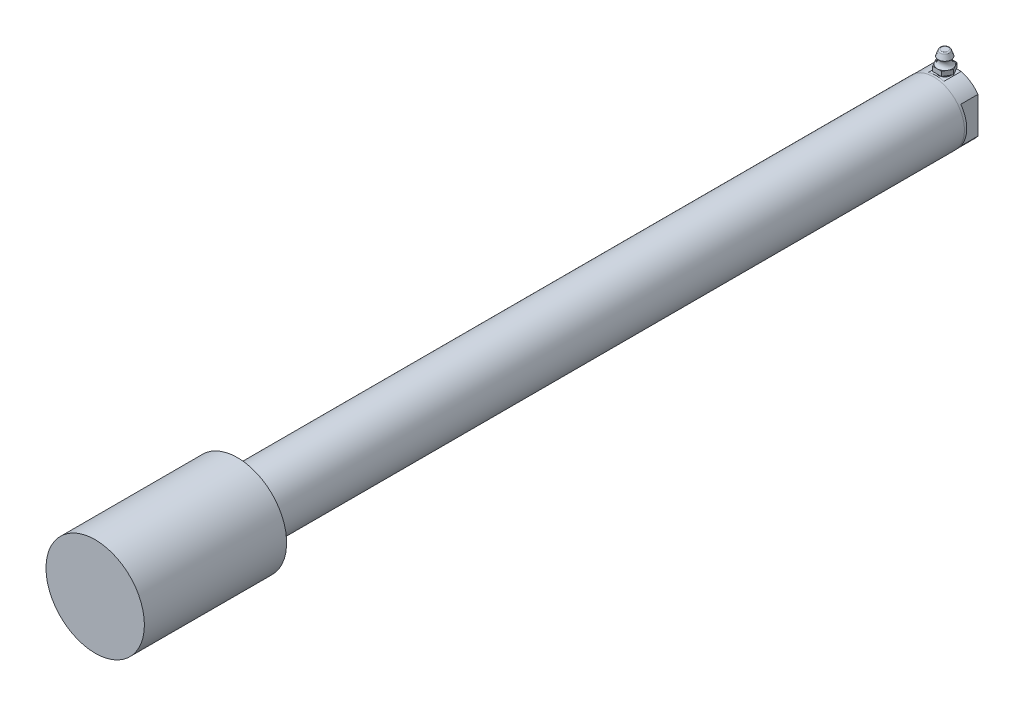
ISO-10303-21;
HEADER;
FILE_DESCRIPTION(('STEP AP214'),'2;1');
FILE_NAME('part.step','',(''),(''),'','','');
FILE_SCHEMA(('AUTOMOTIVE_DESIGN { 1 0 10303 214 1 1 1 1 }'));
ENDSEC;
DATA;
#1=APPLICATION_CONTEXT('core data for automotive mechanical design processes');
#2=APPLICATION_PROTOCOL_DEFINITION('international standard','automotive_design',2000,#1);
#3=PRODUCT_CONTEXT('',#1,'mechanical');
#4=PRODUCT('Part','Part','',(#3));
#5=PRODUCT_RELATED_PRODUCT_CATEGORY('part','',(#4));
#6=PRODUCT_DEFINITION_FORMATION('','',#4);
#7=PRODUCT_DEFINITION_CONTEXT('part definition',#1,'design');
#8=PRODUCT_DEFINITION('design','',#6,#7);
#9=PRODUCT_DEFINITION_SHAPE('','',#8);
#10=(LENGTH_UNIT() NAMED_UNIT(*) SI_UNIT(.MILLI.,.METRE.));
#11=(NAMED_UNIT(*) PLANE_ANGLE_UNIT() SI_UNIT($,.RADIAN.));
#12=(NAMED_UNIT(*) SI_UNIT($,.STERADIAN.) SOLID_ANGLE_UNIT());
#13=UNCERTAINTY_MEASURE_WITH_UNIT(LENGTH_MEASURE(1.E-05),#10,'distance_accuracy_value','');
#14=(GEOMETRIC_REPRESENTATION_CONTEXT(3) GLOBAL_UNCERTAINTY_ASSIGNED_CONTEXT((#13)) GLOBAL_UNIT_ASSIGNED_CONTEXT((#10,
#11,#12)) REPRESENTATION_CONTEXT('',''));
#15=CARTESIAN_POINT('',(0.,0.,0.));
#16=DIRECTION('',(0.,0.,1.));
#17=DIRECTION('',(1.,0.,0.));
#18=AXIS2_PLACEMENT_3D('',#15,#16,#17);
#19=CARTESIAN_POINT('',(0.,0.,10.16));
#20=DIRECTION('',(0.,0.,-1.));
#21=DIRECTION('',(0.,1.,0.));
#22=AXIS2_PLACEMENT_3D('',#19,#20,#21);
#23=CYLINDRICAL_SURFACE('',#22,15.7607);
#24=DIRECTION('',(0.,0.,-1.));
#25=VECTOR('',#24,1.);
#26=CARTESIAN_POINT('',(4.01771881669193,15.24,8.89));
#27=LINE('',#26,#25);
#28=CARTESIAN_POINT('',(4.01771881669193,15.24,8.89));
#29=VERTEX_POINT('',#28);
#30=CARTESIAN_POINT('',(4.01771881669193,15.24,0.));
#31=VERTEX_POINT('',#30);
#32=EDGE_CURVE('E86',#29,#31,#27,.T.);
#33=ORIENTED_EDGE('',*,*,#32,.F.);
#34=CARTESIAN_POINT('',(0.,0.,8.89));
#35=DIRECTION('',(0.,0.,-1.));
#36=DIRECTION('',(0.,1.,0.));
#37=AXIS2_PLACEMENT_3D('',#34,#35,#36);
#38=CIRCLE('',#37,15.7607);
#39=CARTESIAN_POINT('',(-4.01771881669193,15.24,8.89));
#40=VERTEX_POINT('',#39);
#41=EDGE_CURVE('E270',#29,#40,#38,.F.);
#42=ORIENTED_EDGE('',*,*,#41,.T.);
#43=DIRECTION('',(0.,0.,-1.));
#44=VECTOR('',#43,1.);
#45=CARTESIAN_POINT('',(-4.01771881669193,15.24,8.89));
#46=LINE('',#45,#44);
#47=CARTESIAN_POINT('',(-4.01771881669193,15.24,0.));
#48=VERTEX_POINT('',#47);
#49=EDGE_CURVE('E230',#40,#48,#46,.T.);
#50=ORIENTED_EDGE('',*,*,#49,.T.);
#51=CARTESIAN_POINT('',(0.,0.,0.));
#52=DIRECTION('',(0.,0.,-1.));
#53=DIRECTION('',(0.,1.,0.));
#54=AXIS2_PLACEMENT_3D('',#51,#52,#53);
#55=CIRCLE('',#54,15.7607);
#56=CARTESIAN_POINT('',(-12.7,9.33325583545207,0.));
#57=VERTEX_POINT('',#56);
#58=EDGE_CURVE('E274',#57,#48,#55,.T.);
#59=ORIENTED_EDGE('',*,*,#58,.F.);
#60=DIRECTION('',(0.,0.,-1.));
#61=VECTOR('',#60,1.);
#62=CARTESIAN_POINT('',(-12.7,9.33325583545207,8.89));
#63=LINE('',#62,#61);
#64=CARTESIAN_POINT('',(-12.7,9.33325583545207,8.89));
#65=VERTEX_POINT('',#64);
#66=EDGE_CURVE('E79',#65,#57,#63,.T.);
#67=ORIENTED_EDGE('',*,*,#66,.F.);
#68=CARTESIAN_POINT('',(0.,0.,8.89));
#69=DIRECTION('',(0.,0.,-1.));
#70=DIRECTION('',(0.,1.,0.));
#71=AXIS2_PLACEMENT_3D('',#68,#69,#70);
#72=CIRCLE('',#71,15.7607);
#73=CARTESIAN_POINT('',(-12.7,-9.33325583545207,8.89));
#74=VERTEX_POINT('',#73);
#75=EDGE_CURVE('E237',#74,#65,#72,.T.);
#76=ORIENTED_EDGE('',*,*,#75,.F.);
#77=DIRECTION('',(0.,0.,-1.));
#78=VECTOR('',#77,1.);
#79=CARTESIAN_POINT('',(-12.7,-9.33325583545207,8.89));
#80=LINE('',#79,#78);
#81=CARTESIAN_POINT('',(-12.7,-9.33325583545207,0.));
#82=VERTEX_POINT('',#81);
#83=EDGE_CURVE('E243',#74,#82,#80,.T.);
#84=ORIENTED_EDGE('',*,*,#83,.T.);
#85=CARTESIAN_POINT('',(12.7,-9.33325583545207,0.));
#86=VERTEX_POINT('',#85);
#87=EDGE_CURVE('E271',#86,#82,#55,.T.);
#88=ORIENTED_EDGE('',*,*,#87,.F.);
#89=DIRECTION('',(0.,0.,-1.));
#90=VECTOR('',#89,1.);
#91=CARTESIAN_POINT('',(12.7,-9.33325583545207,8.89));
#92=LINE('',#91,#90);
#93=CARTESIAN_POINT('',(12.7,-9.33325583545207,8.89));
#94=VERTEX_POINT('',#93);
#95=EDGE_CURVE('E253',#94,#86,#92,.T.);
#96=ORIENTED_EDGE('',*,*,#95,.F.);
#97=CARTESIAN_POINT('',(0.,0.,8.89));
#98=DIRECTION('',(0.,0.,-1.));
#99=DIRECTION('',(0.,1.,0.));
#100=AXIS2_PLACEMENT_3D('',#97,#98,#99);
#101=CIRCLE('',#100,15.7607);
#102=CARTESIAN_POINT('',(12.7,9.33325583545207,8.89));
#103=VERTEX_POINT('',#102);
#104=EDGE_CURVE('E248',#103,#94,#101,.T.);
#105=ORIENTED_EDGE('',*,*,#104,.F.);
#106=DIRECTION('',(0.,0.,-1.));
#107=VECTOR('',#106,1.);
#108=CARTESIAN_POINT('',(12.7,9.33325583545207,8.89));
#109=LINE('',#108,#107);
#110=CARTESIAN_POINT('',(12.7,9.33325583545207,0.));
#111=VERTEX_POINT('',#110);
#112=EDGE_CURVE('E256',#103,#111,#109,.T.);
#113=ORIENTED_EDGE('',*,*,#112,.T.);
#114=EDGE_CURVE('E266',#31,#111,#55,.T.);
#115=ORIENTED_EDGE('',*,*,#114,.F.);
#116=EDGE_LOOP('',(#33,#42,#50,#59,#67,#76,#84,#88,#96,#105,#113,#115));
#117=FACE_BOUND('',#116,.T.);
#118=CARTESIAN_POINT('',(0.,0.,10.16));
#119=DIRECTION('',(0.,0.,-1.));
#120=DIRECTION('',(0.,1.,0.));
#121=AXIS2_PLACEMENT_3D('',#118,#119,#120);
#122=CIRCLE('',#121,15.7607);
#123=CARTESIAN_POINT('',(0.,15.7607,10.16));
#124=VERTEX_POINT('',#123);
#125=EDGE_CURVE('E267',#124,#124,#122,.T.);
#126=ORIENTED_EDGE('',*,*,#125,.T.);
#127=EDGE_LOOP('',(#126));
#128=FACE_BOUND('',#127,.T.);
#129=ADVANCED_FACE('F16',(#117,#128),#23,.T.);
#130=CARTESIAN_POINT('',(0.,0.,0.));
#131=DIRECTION('',(0.,0.,-1.));
#132=DIRECTION('',(0.,1.,0.));
#133=AXIS2_PLACEMENT_3D('',#130,#131,#132);
#134=PLANE('',#133);
#135=DIRECTION('',(-1.,0.,0.));
#136=VECTOR('',#135,1.);
#137=CARTESIAN_POINT('',(4.01771881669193,15.24,0.));
#138=LINE('',#137,#136);
#139=EDGE_CURVE('E231',#31,#48,#138,.T.);
#140=ORIENTED_EDGE('',*,*,#139,.F.);
#141=ORIENTED_EDGE('',*,*,#114,.T.);
#142=DIRECTION('',(0.,1.,0.));
#143=VECTOR('',#142,1.);
#144=CARTESIAN_POINT('',(12.7,-9.33325583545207,0.));
#145=LINE('',#144,#143);
#146=EDGE_CURVE('E246',#86,#111,#145,.T.);
#147=ORIENTED_EDGE('',*,*,#146,.F.);
#148=ORIENTED_EDGE('',*,*,#87,.T.);
#149=DIRECTION('',(0.,-1.,0.));
#150=VECTOR('',#149,1.);
#151=CARTESIAN_POINT('',(-12.7,-9.33325583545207,0.));
#152=LINE('',#151,#150);
#153=EDGE_CURVE('E234',#57,#82,#152,.T.);
#154=ORIENTED_EDGE('',*,*,#153,.F.);
#155=ORIENTED_EDGE('',*,*,#58,.T.);
#156=EDGE_LOOP('',(#140,#141,#147,#148,#154,#155));
#157=FACE_BOUND('',#156,.T.);
#158=CARTESIAN_POINT('',(0.,0.,0.));
#159=DIRECTION('',(0.,0.,-1.));
#160=DIRECTION('',(0.,1.,0.));
#161=AXIS2_PLACEMENT_3D('',#158,#159,#160);
#162=CIRCLE('',#161,4.96062);
#163=CARTESIAN_POINT('',(0.,4.96062,0.));
#164=VERTEX_POINT('',#163);
#165=EDGE_CURVE('E263',#164,#164,#162,.T.);
#166=ORIENTED_EDGE('',*,*,#165,.F.);
#167=EDGE_LOOP('',(#166));
#168=FACE_BOUND('',#167,.T.);
#169=ADVANCED_FACE('F383',(#157,#168),#134,.T.);
#170=CARTESIAN_POINT('',(0.,0.,0.));
#171=DIRECTION('',(0.,0.,-1.));
#172=DIRECTION('',(0.,1.,0.));
#173=AXIS2_PLACEMENT_3D('',#170,#171,#172);
#174=CYLINDRICAL_SURFACE('',#173,4.96062);
#175=CARTESIAN_POINT('',(0.,0.,32.512));
#176=DIRECTION('',(0.,0.,-1.));
#177=DIRECTION('',(0.,1.,0.));
#178=AXIS2_PLACEMENT_3D('',#175,#176,#177);
#179=CIRCLE('',#178,4.96062);
#180=CARTESIAN_POINT('',(0.,4.96062,32.512));
#181=VERTEX_POINT('',#180);
#182=EDGE_CURVE('E259',#181,#181,#179,.T.);
#183=ORIENTED_EDGE('',*,*,#182,.F.);
#184=EDGE_LOOP('',(#183));
#185=FACE_BOUND('',#184,.T.);
#186=ORIENTED_EDGE('',*,*,#165,.T.);
#187=EDGE_LOOP('',(#186));
#188=FACE_BOUND('',#187,.T.);
#189=ADVANCED_FACE('F379',(#185,#188),#174,.F.);
#190=CARTESIAN_POINT('',(0.,0.,32.512));
#191=DIRECTION('',(0.,0.,-1.));
#192=DIRECTION('',(0.,1.,0.));
#193=AXIS2_PLACEMENT_3D('',#190,#191,#192);
#194=CONICAL_SURFACE('',#193,4.96062,1.02974425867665);
#195=CARTESIAN_POINT('',(0.,0.,35.4926412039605));
#196=VERTEX_POINT('',#195);
#197=VERTEX_LOOP('',#196);
#198=FACE_BOUND('',#197,.T.);
#199=ORIENTED_EDGE('',*,*,#182,.T.);
#200=EDGE_LOOP('',(#199));
#201=FACE_BOUND('',#200,.T.);
#202=ADVANCED_FACE('F375',(#198,#201),#194,.F.);
#203=CARTESIAN_POINT('',(12.7,-9.33325583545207,8.89));
#204=DIRECTION('',(-1.,0.,0.));
#205=DIRECTION('',(0.,0.,1.));
#206=AXIS2_PLACEMENT_3D('',#203,#204,#205);
#207=PLANE('',#206);
#208=ORIENTED_EDGE('',*,*,#146,.T.);
#209=ORIENTED_EDGE('',*,*,#112,.F.);
#210=DIRECTION('',(0.,1.,0.));
#211=VECTOR('',#210,1.);
#212=CARTESIAN_POINT('',(12.7,-9.33325583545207,8.89));
#213=LINE('',#212,#211);
#214=EDGE_CURVE('E250',#94,#103,#213,.T.);
#215=ORIENTED_EDGE('',*,*,#214,.F.);
#216=ORIENTED_EDGE('',*,*,#95,.T.);
#217=EDGE_LOOP('',(#208,#209,#215,#216));
#218=FACE_BOUND('',#217,.T.);
#219=ADVANCED_FACE('F371',(#218),#207,.F.);
#220=CARTESIAN_POINT('',(0.,0.,8.89));
#221=DIRECTION('',(0.,0.,-1.));
#222=DIRECTION('',(0.,1.,0.));
#223=AXIS2_PLACEMENT_3D('',#220,#221,#222);
#224=PLANE('',#223);
#225=ORIENTED_EDGE('',*,*,#104,.T.);
#226=ORIENTED_EDGE('',*,*,#214,.T.);
#227=EDGE_LOOP('',(#225,#226));
#228=FACE_BOUND('',#227,.T.);
#229=ADVANCED_FACE('F368',(#228),#224,.T.);
#230=CARTESIAN_POINT('',(-12.7,-9.33325583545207,8.89));
#231=DIRECTION('',(1.,0.,0.));
#232=DIRECTION('',(0.,0.,-1.));
#233=AXIS2_PLACEMENT_3D('',#230,#231,#232);
#234=PLANE('',#233);
#235=ORIENTED_EDGE('',*,*,#153,.T.);
#236=ORIENTED_EDGE('',*,*,#83,.F.);
#237=DIRECTION('',(0.,-1.,0.));
#238=VECTOR('',#237,1.);
#239=CARTESIAN_POINT('',(-12.7,-9.33325583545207,8.89));
#240=LINE('',#239,#238);
#241=EDGE_CURVE('E239',#65,#74,#240,.T.);
#242=ORIENTED_EDGE('',*,*,#241,.F.);
#243=ORIENTED_EDGE('',*,*,#66,.T.);
#244=EDGE_LOOP('',(#235,#236,#242,#243));
#245=FACE_BOUND('',#244,.T.);
#246=ADVANCED_FACE('F364',(#245),#234,.F.);
#247=CARTESIAN_POINT('',(0.,0.,8.89));
#248=DIRECTION('',(0.,0.,-1.));
#249=DIRECTION('',(0.,1.,0.));
#250=AXIS2_PLACEMENT_3D('',#247,#248,#249);
#251=PLANE('',#250);
#252=ORIENTED_EDGE('',*,*,#75,.T.);
#253=ORIENTED_EDGE('',*,*,#241,.T.);
#254=EDGE_LOOP('',(#252,#253));
#255=FACE_BOUND('',#254,.T.);
#256=ADVANCED_FACE('F360',(#255),#251,.T.);
#257=CARTESIAN_POINT('',(4.01771881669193,15.24,8.89));
#258=DIRECTION('',(0.,-1.,0.));
#259=DIRECTION('',(0.,0.,-1.));
#260=AXIS2_PLACEMENT_3D('',#257,#258,#259);
#261=PLANE('',#260);
#262=CARTESIAN_POINT('',(0.,15.24,4.445));
#263=DIRECTION('',(0.,-1.,0.));
#264=DIRECTION('',(1.,0.,0.));
#265=AXIS2_PLACEMENT_3D('',#262,#263,#264);
#266=CIRCLE('',#265,3.21504291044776);
#267=CARTESIAN_POINT('',(3.21504291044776,15.24,4.445));
#268=VERTEX_POINT('',#267);
#269=EDGE_CURVE('E10',#268,#268,#266,.F.);
#270=ORIENTED_EDGE('',*,*,#269,.F.);
#271=EDGE_LOOP('',(#270));
#272=FACE_BOUND('',#271,.T.);
#273=ORIENTED_EDGE('',*,*,#139,.T.);
#274=ORIENTED_EDGE('',*,*,#49,.F.);
#275=DIRECTION('',(-1.,0.,0.));
#276=VECTOR('',#275,1.);
#277=CARTESIAN_POINT('',(4.01771881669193,15.24,8.89));
#278=LINE('',#277,#276);
#279=EDGE_CURVE('E227',#29,#40,#278,.T.);
#280=ORIENTED_EDGE('',*,*,#279,.F.);
#281=ORIENTED_EDGE('',*,*,#32,.T.);
#282=EDGE_LOOP('',(#273,#274,#280,#281));
#283=FACE_BOUND('',#282,.T.);
#284=ADVANCED_FACE('F356',(#272,#283),#261,.F.);
#285=CARTESIAN_POINT('',(-4.01771881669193,15.24,8.89));
#286=DIRECTION('',(0.,0.,-1.));
#287=DIRECTION('',(0.,1.,0.));
#288=AXIS2_PLACEMENT_3D('',#285,#286,#287);
#289=PLANE('',#288);
#290=ORIENTED_EDGE('',*,*,#41,.F.);
#291=ORIENTED_EDGE('',*,*,#279,.T.);
#292=EDGE_LOOP('',(#290,#291));
#293=FACE_BOUND('',#292,.T.);
#294=ADVANCED_FACE('F353',(#293),#289,.T.);
#295=CARTESIAN_POINT('',(0.,0.,443.08014));
#296=DIRECTION('',(0.,0.,1.));
#297=DIRECTION('',(1.,0.,0.));
#298=AXIS2_PLACEMENT_3D('',#295,#296,#297);
#299=PLANE('',#298);
#300=CARTESIAN_POINT('',(0.,0.,443.08014));
#301=DIRECTION('',(0.,0.,1.));
#302=DIRECTION('',(1.,0.,0.));
#303=AXIS2_PLACEMENT_3D('',#300,#301,#302);
#304=CIRCLE('',#303,25.4);
#305=CARTESIAN_POINT('',(25.4,0.,443.08014));
#306=VERTEX_POINT('',#305);
#307=EDGE_CURVE('E279',#306,#306,#304,.T.);
#308=ORIENTED_EDGE('',*,*,#307,.T.);
#309=EDGE_LOOP('',(#308));
#310=FACE_BOUND('',#309,.T.);
#311=ADVANCED_FACE('F303',(#310),#299,.T.);
#312=CARTESIAN_POINT('',(0.,0.,443.08014));
#313=DIRECTION('',(0.,0.,-1.));
#314=DIRECTION('',(-1.,0.,0.));
#315=AXIS2_PLACEMENT_3D('',#312,#313,#314);
#316=CYLINDRICAL_SURFACE('',#315,25.4);
#317=ORIENTED_EDGE('',*,*,#307,.F.);
#318=EDGE_LOOP('',(#317));
#319=FACE_BOUND('',#318,.T.);
#320=CARTESIAN_POINT('',(0.,0.,369.6462));
#321=DIRECTION('',(0.,0.,-1.));
#322=DIRECTION('',(-1.,0.,0.));
#323=AXIS2_PLACEMENT_3D('',#320,#321,#322);
#324=CIRCLE('',#323,25.4);
#325=CARTESIAN_POINT('',(-25.4,0.,369.6462));
#326=VERTEX_POINT('',#325);
#327=EDGE_CURVE('E276',#326,#326,#324,.T.);
#328=ORIENTED_EDGE('',*,*,#327,.F.);
#329=EDGE_LOOP('',(#328));
#330=FACE_BOUND('',#329,.T.);
#331=ADVANCED_FACE('F301',(#319,#330),#316,.T.);
#332=CARTESIAN_POINT('',(0.,0.,369.6462));
#333=DIRECTION('',(0.,0.,-1.));
#334=DIRECTION('',(-1.,0.,0.));
#335=AXIS2_PLACEMENT_3D('',#332,#333,#334);
#336=PLANE('',#335);
#337=CARTESIAN_POINT('',(0.,0.,369.6462));
#338=DIRECTION('',(0.,0.,-1.));
#339=DIRECTION('',(-1.,0.,0.));
#340=AXIS2_PLACEMENT_3D('',#337,#338,#339);
#341=CIRCLE('',#340,15.8496);
#342=CARTESIAN_POINT('',(-15.8496,0.,369.6462));
#343=VERTEX_POINT('',#342);
#344=EDGE_CURVE('E20',#343,#343,#341,.F.);
#345=ORIENTED_EDGE('',*,*,#344,.T.);
#346=EDGE_LOOP('',(#345));
#347=FACE_BOUND('',#346,.T.);
#348=ORIENTED_EDGE('',*,*,#327,.T.);
#349=EDGE_LOOP('',(#348));
#350=FACE_BOUND('',#349,.T.);
#351=ADVANCED_FACE('F288',(#347,#350),#336,.T.);
#352=CARTESIAN_POINT('',(0.,0.,382.0922));
#353=DIRECTION('',(0.,0.,-1.));
#354=DIRECTION('',(-1.,0.,0.));
#355=AXIS2_PLACEMENT_3D('',#352,#353,#354);
#356=CYLINDRICAL_SURFACE('',#355,15.8496);
#357=ORIENTED_EDGE('',*,*,#344,.F.);
#358=EDGE_LOOP('',(#357));
#359=FACE_BOUND('',#358,.T.);
#360=CARTESIAN_POINT('',(0.,0.,10.16));
#361=DIRECTION('',(0.,0.,-1.));
#362=DIRECTION('',(-1.,0.,0.));
#363=AXIS2_PLACEMENT_3D('',#360,#361,#362);
#364=CIRCLE('',#363,15.8496);
#365=CARTESIAN_POINT('',(-15.8496,0.,10.16));
#366=VERTEX_POINT('',#365);
#367=EDGE_CURVE('E281',#366,#366,#364,.T.);
#368=ORIENTED_EDGE('',*,*,#367,.F.);
#369=EDGE_LOOP('',(#368));
#370=FACE_BOUND('',#369,.T.);
#371=ADVANCED_FACE('F18',(#359,#370),#356,.T.);
#372=CARTESIAN_POINT('',(0.,0.,10.16));
#373=DIRECTION('',(0.,0.,-1.));
#374=DIRECTION('',(-1.,0.,0.));
#375=AXIS2_PLACEMENT_3D('',#372,#373,#374);
#376=PLANE('',#375);
#377=ORIENTED_EDGE('',*,*,#367,.T.);
#378=EDGE_LOOP('',(#377));
#379=FACE_BOUND('',#378,.T.);
#380=ORIENTED_EDGE('',*,*,#125,.F.);
#381=EDGE_LOOP('',(#380));
#382=FACE_BOUND('',#381,.T.);
#383=ADVANCED_FACE('F293',(#379,#382),#376,.T.);
#384=CARTESIAN_POINT('',(0.,25.4,4.445));
#385=DIRECTION('',(0.,1.,0.));
#386=DIRECTION('',(0.,0.,1.));
#387=AXIS2_PLACEMENT_3D('',#384,#385,#386);
#388=PLANE('',#387);
#389=CARTESIAN_POINT('',(0.,25.4,4.445));
#390=DIRECTION('',(0.,1.,0.));
#391=DIRECTION('',(0.,0.,1.));
#392=AXIS2_PLACEMENT_3D('',#389,#390,#391);
#393=CIRCLE('',#392,1.7474960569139);
#394=CARTESIAN_POINT('',(0.,25.4,6.1924960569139));
#395=VERTEX_POINT('',#394);
#396=EDGE_CURVE('E26',#395,#395,#393,.T.);
#397=ORIENTED_EDGE('',*,*,#396,.T.);
#398=EDGE_LOOP('',(#397));
#399=FACE_BOUND('',#398,.T.);
#400=ADVANCED_FACE('F300',(#399),#388,.T.);
#401=CARTESIAN_POINT('',(0.,24.638,4.445));
#402=DIRECTION('',(0.,1.,0.));
#403=DIRECTION('',(0.,0.,1.));
#404=AXIS2_PLACEMENT_3D('',#401,#402,#403);
#405=TOROIDAL_SURFACE('',#404,1.7474960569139,0.762);
#406=ORIENTED_EDGE('',*,*,#396,.F.);
#407=EDGE_LOOP('',(#406));
#408=FACE_BOUND('',#407,.T.);
#409=CARTESIAN_POINT('',(0.,24.8923915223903,4.445));
#410=DIRECTION('',(0.,1.,0.));
#411=DIRECTION('',(0.,0.,1.));
#412=AXIS2_PLACEMENT_3D('',#409,#410,#411);
#413=CIRCLE('',#412,2.46577800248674);
#414=CARTESIAN_POINT('',(0.,24.8923915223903,6.91077800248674));
#415=VERTEX_POINT('',#414);
#416=EDGE_CURVE('E222',#415,#415,#413,.F.);
#417=ORIENTED_EDGE('',*,*,#416,.F.);
#418=EDGE_LOOP('',(#417));
#419=FACE_BOUND('',#418,.T.);
#420=ADVANCED_FACE('F305',(#408,#419),#405,.T.);
#421=CARTESIAN_POINT('',(0.,22.352,4.445));
#422=DIRECTION('',(0.,-1.,0.));
#423=DIRECTION('',(0.,0.,-1.));
#424=AXIS2_PLACEMENT_3D('',#421,#422,#423);
#425=CONICAL_SURFACE('',#424,3.3655,0.340381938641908);
#426=ORIENTED_EDGE('',*,*,#416,.T.);
#427=EDGE_LOOP('',(#426));
#428=FACE_BOUND('',#427,.T.);
#429=CARTESIAN_POINT('',(0.,22.352,4.445));
#430=DIRECTION('',(0.,-1.,0.));
#431=DIRECTION('',(0.,0.,-1.));
#432=AXIS2_PLACEMENT_3D('',#429,#430,#431);
#433=CIRCLE('',#432,3.3655);
#434=CARTESIAN_POINT('',(0.,22.352,1.0795));
#435=VERTEX_POINT('',#434);
#436=EDGE_CURVE('E175',#435,#435,#433,.T.);
#437=ORIENTED_EDGE('',*,*,#436,.F.);
#438=EDGE_LOOP('',(#437));
#439=FACE_BOUND('',#438,.T.);
#440=ADVANCED_FACE('F312',(#428,#439),#425,.T.);
#441=CARTESIAN_POINT('',(0.,20.7536902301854,4.445));
#442=DIRECTION('',(0.,-1.,0.));
#443=DIRECTION('',(0.,0.,-1.));
#444=AXIS2_PLACEMENT_3D('',#441,#442,#443);
#445=TOROIDAL_SURFACE('',#444,5.20693450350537,2.43833450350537);
#446=ORIENTED_EDGE('',*,*,#436,.T.);
#447=EDGE_LOOP('',(#446));
#448=FACE_BOUND('',#447,.T.);
#449=CARTESIAN_POINT('',(0.,18.653125,4.445));
#450=DIRECTION('',(0.,-1.,0.));
#451=DIRECTION('',(0.,0.,-1.));
#452=AXIS2_PLACEMENT_3D('',#449,#450,#451);
#453=CIRCLE('',#452,3.96875);
#454=CARTESIAN_POINT('',(0.,18.653125,0.47625));
#455=VERTEX_POINT('',#454);
#456=CARTESIAN_POINT('',(3.43703832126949,18.653125,2.460625));
#457=VERTEX_POINT('',#456);
#458=EDGE_CURVE('E35',#455,#457,#453,.T.);
#459=ORIENTED_EDGE('',*,*,#458,.F.);
#460=CARTESIAN_POINT('',(-3.43703832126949,18.653125,2.460625));
#461=VERTEX_POINT('',#460);
#462=EDGE_CURVE('E171',#461,#455,#453,.T.);
#463=ORIENTED_EDGE('',*,*,#462,.F.);
#464=CARTESIAN_POINT('',(-3.43703832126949,18.653125,6.429375));
#465=VERTEX_POINT('',#464);
#466=EDGE_CURVE('E170',#465,#461,#453,.T.);
#467=ORIENTED_EDGE('',*,*,#466,.F.);
#468=CARTESIAN_POINT('',(0.,18.653125,8.41375));
#469=VERTEX_POINT('',#468);
#470=EDGE_CURVE('E150',#469,#465,#453,.T.);
#471=ORIENTED_EDGE('',*,*,#470,.F.);
#472=CARTESIAN_POINT('',(3.43703832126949,18.653125,6.429375));
#473=VERTEX_POINT('',#472);
#474=EDGE_CURVE('E139',#473,#469,#453,.T.);
#475=ORIENTED_EDGE('',*,*,#474,.F.);
#476=EDGE_CURVE('E149',#457,#473,#453,.T.);
#477=ORIENTED_EDGE('',*,*,#476,.F.);
#478=EDGE_LOOP('',(#459,#463,#467,#471,#475,#477));
#479=FACE_BOUND('',#478,.T.);
#480=ADVANCED_FACE('F168',(#448,#479),#445,.F.);
#481=CARTESIAN_POINT('',(-2.29135888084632,18.653125,0.47625));
#482=DIRECTION('',(0.,1.,0.));
#483=DIRECTION('',(1.,0.,0.));
#484=AXIS2_PLACEMENT_3D('',#481,#482,#483);
#485=PLANE('',#484);
#486=ORIENTED_EDGE('',*,*,#466,.T.);
#487=DIRECTION('',(-0.5,0.,0.866025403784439));
#488=VECTOR('',#487,1.);
#489=CARTESIAN_POINT('',(-2.29135888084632,18.653125,0.47625));
#490=LINE('',#489,#488);
#491=CARTESIAN_POINT('',(-4.58271776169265,18.653125,4.445));
#492=VERTEX_POINT('',#491);
#493=EDGE_CURVE('E184',#461,#492,#490,.T.);
#494=ORIENTED_EDGE('',*,*,#493,.T.);
#495=DIRECTION('',(0.5,0.,0.866025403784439));
#496=VECTOR('',#495,1.);
#497=CARTESIAN_POINT('',(-4.58271776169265,18.653125,4.445));
#498=LINE('',#497,#496);
#499=EDGE_CURVE('E95',#492,#465,#498,.T.);
#500=ORIENTED_EDGE('',*,*,#499,.T.);
#501=EDGE_LOOP('',(#486,#494,#500));
#502=FACE_BOUND('',#501,.T.);
#503=ADVANCED_FACE('F322',(#502),#485,.T.);
#504=ORIENTED_EDGE('',*,*,#470,.T.);
#505=CARTESIAN_POINT('',(-2.29135888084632,18.653125,8.41375));
#506=VERTEX_POINT('',#505);
#507=EDGE_CURVE('E165',#465,#506,#498,.T.);
#508=ORIENTED_EDGE('',*,*,#507,.T.);
#509=DIRECTION('',(1.,0.,0.));
#510=VECTOR('',#509,1.);
#511=CARTESIAN_POINT('',(-2.29135888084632,18.653125,8.41375));
#512=LINE('',#511,#510);
#513=EDGE_CURVE('E157',#506,#469,#512,.T.);
#514=ORIENTED_EDGE('',*,*,#513,.T.);
#515=EDGE_LOOP('',(#504,#508,#514));
#516=FACE_BOUND('',#515,.T.);
#517=ADVANCED_FACE('F163',(#516),#485,.T.);
#518=ORIENTED_EDGE('',*,*,#474,.T.);
#519=CARTESIAN_POINT('',(2.29135888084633,18.653125,8.41375));
#520=VERTEX_POINT('',#519);
#521=EDGE_CURVE('E142',#469,#520,#512,.T.);
#522=ORIENTED_EDGE('',*,*,#521,.T.);
#523=DIRECTION('',(0.5,0.,-0.866025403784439));
#524=VECTOR('',#523,1.);
#525=CARTESIAN_POINT('',(2.29135888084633,18.653125,8.41375));
#526=LINE('',#525,#524);
#527=EDGE_CURVE('E145',#520,#473,#526,.T.);
#528=ORIENTED_EDGE('',*,*,#527,.T.);
#529=EDGE_LOOP('',(#518,#522,#528));
#530=FACE_BOUND('',#529,.T.);
#531=ADVANCED_FACE('F141',(#530),#485,.T.);
#532=ORIENTED_EDGE('',*,*,#476,.T.);
#533=CARTESIAN_POINT('',(4.58271776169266,18.653125,4.445));
#534=VERTEX_POINT('',#533);
#535=EDGE_CURVE('E167',#473,#534,#526,.T.);
#536=ORIENTED_EDGE('',*,*,#535,.T.);
#537=DIRECTION('',(-0.5,0.,-0.866025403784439));
#538=VECTOR('',#537,1.);
#539=CARTESIAN_POINT('',(4.58271776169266,18.653125,4.445));
#540=LINE('',#539,#538);
#541=EDGE_CURVE('E192',#534,#457,#540,.T.);
#542=ORIENTED_EDGE('',*,*,#541,.T.);
#543=EDGE_LOOP('',(#532,#536,#542));
#544=FACE_BOUND('',#543,.T.);
#545=ADVANCED_FACE('F614',(#544),#485,.T.);
#546=ORIENTED_EDGE('',*,*,#458,.T.);
#547=CARTESIAN_POINT('',(2.29135888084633,18.653125,0.47625));
#548=VERTEX_POINT('',#547);
#549=EDGE_CURVE('E191',#457,#548,#540,.T.);
#550=ORIENTED_EDGE('',*,*,#549,.T.);
#551=DIRECTION('',(-1.,0.,0.));
#552=VECTOR('',#551,1.);
#553=CARTESIAN_POINT('',(2.29135888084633,18.653125,0.47625));
#554=LINE('',#553,#552);
#555=EDGE_CURVE('E182',#548,#455,#554,.T.);
#556=ORIENTED_EDGE('',*,*,#555,.T.);
#557=EDGE_LOOP('',(#546,#550,#556));
#558=FACE_BOUND('',#557,.T.);
#559=ADVANCED_FACE('F621',(#558),#485,.T.);
#560=ORIENTED_EDGE('',*,*,#462,.T.);
#561=CARTESIAN_POINT('',(-2.29135888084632,18.653125,0.47625));
#562=VERTEX_POINT('',#561);
#563=EDGE_CURVE('E185',#455,#562,#554,.T.);
#564=ORIENTED_EDGE('',*,*,#563,.T.);
#565=EDGE_CURVE('E186',#562,#461,#490,.T.);
#566=ORIENTED_EDGE('',*,*,#565,.T.);
#567=EDGE_LOOP('',(#560,#564,#566));
#568=FACE_BOUND('',#567,.T.);
#569=ADVANCED_FACE('F325',(#568),#485,.T.);
#570=CARTESIAN_POINT('',(-2.29135888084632,18.653125,0.47625));
#571=DIRECTION('',(0.866025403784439,0.,0.5));
#572=DIRECTION('',(0.5,0.,-0.866025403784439));
#573=AXIS2_PLACEMENT_3D('',#570,#571,#572);
#574=PLANE('',#573);
#575=DIRECTION('',(-0.5,0.,0.866025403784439));
#576=VECTOR('',#575,1.);
#577=CARTESIAN_POINT('',(-2.29135888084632,16.271875,0.47625));
#578=LINE('',#577,#576);
#579=CARTESIAN_POINT('',(-2.29135888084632,16.271875,0.47625));
#580=VERTEX_POINT('',#579);
#581=CARTESIAN_POINT('',(-4.58271776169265,16.271875,4.445));
#582=VERTEX_POINT('',#581);
#583=EDGE_CURVE('E198',#580,#582,#578,.T.);
#584=ORIENTED_EDGE('',*,*,#583,.T.);
#585=DIRECTION('',(0.,-1.,0.));
#586=VECTOR('',#585,1.);
#587=CARTESIAN_POINT('',(-4.58271776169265,18.653125,4.445));
#588=LINE('',#587,#586);
#589=EDGE_CURVE('E216',#492,#582,#588,.T.);
#590=ORIENTED_EDGE('',*,*,#589,.F.);
#591=ORIENTED_EDGE('',*,*,#493,.F.);
#592=ORIENTED_EDGE('',*,*,#565,.F.);
#593=DIRECTION('',(0.,-1.,0.));
#594=VECTOR('',#593,1.);
#595=CARTESIAN_POINT('',(-2.29135888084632,18.653125,0.47625));
#596=LINE('',#595,#594);
#597=EDGE_CURVE('E219',#562,#580,#596,.T.);
#598=ORIENTED_EDGE('',*,*,#597,.T.);
#599=EDGE_LOOP('',(#584,#590,#591,#592,#598));
#600=FACE_BOUND('',#599,.T.);
#601=ADVANCED_FACE('F345',(#600),#574,.F.);
#602=CARTESIAN_POINT('',(-4.58271776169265,18.653125,4.445));
#603=DIRECTION('',(0.866025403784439,0.,-0.5));
#604=DIRECTION('',(-0.5,0.,-0.866025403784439));
#605=AXIS2_PLACEMENT_3D('',#602,#603,#604);
#606=PLANE('',#605);
#607=DIRECTION('',(0.5,0.,0.866025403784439));
#608=VECTOR('',#607,1.);
#609=CARTESIAN_POINT('',(-4.58271776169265,16.271875,4.445));
#610=LINE('',#609,#608);
#611=CARTESIAN_POINT('',(-2.29135888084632,16.271875,8.41375));
#612=VERTEX_POINT('',#611);
#613=EDGE_CURVE('E200',#582,#612,#610,.T.);
#614=ORIENTED_EDGE('',*,*,#613,.T.);
#615=DIRECTION('',(0.,-1.,0.));
#616=VECTOR('',#615,1.);
#617=CARTESIAN_POINT('',(-2.29135888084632,18.653125,8.41375));
#618=LINE('',#617,#616);
#619=EDGE_CURVE('E214',#506,#612,#618,.T.);
#620=ORIENTED_EDGE('',*,*,#619,.F.);
#621=ORIENTED_EDGE('',*,*,#507,.F.);
#622=ORIENTED_EDGE('',*,*,#499,.F.);
#623=ORIENTED_EDGE('',*,*,#589,.T.);
#624=EDGE_LOOP('',(#614,#620,#621,#622,#623));
#625=FACE_BOUND('',#624,.T.);
#626=ADVANCED_FACE('F342',(#625),#606,.F.);
#627=CARTESIAN_POINT('',(-2.29135888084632,18.653125,8.41375));
#628=DIRECTION('',(0.,0.,-1.));
#629=DIRECTION('',(-1.,0.,0.));
#630=AXIS2_PLACEMENT_3D('',#627,#628,#629);
#631=PLANE('',#630);
#632=DIRECTION('',(1.,0.,0.));
#633=VECTOR('',#632,1.);
#634=CARTESIAN_POINT('',(-2.29135888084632,16.271875,8.41375));
#635=LINE('',#634,#633);
#636=CARTESIAN_POINT('',(2.29135888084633,16.271875,8.41375));
#637=VERTEX_POINT('',#636);
#638=EDGE_CURVE('E202',#612,#637,#635,.T.);
#639=ORIENTED_EDGE('',*,*,#638,.T.);
#640=DIRECTION('',(0.,-1.,0.));
#641=VECTOR('',#640,1.);
#642=CARTESIAN_POINT('',(2.29135888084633,18.653125,8.41375));
#643=LINE('',#642,#641);
#644=EDGE_CURVE('E159',#520,#637,#643,.T.);
#645=ORIENTED_EDGE('',*,*,#644,.F.);
#646=ORIENTED_EDGE('',*,*,#521,.F.);
#647=ORIENTED_EDGE('',*,*,#513,.F.);
#648=ORIENTED_EDGE('',*,*,#619,.T.);
#649=EDGE_LOOP('',(#639,#645,#646,#647,#648));
#650=FACE_BOUND('',#649,.T.);
#651=ADVANCED_FACE('F155',(#650),#631,.F.);
#652=CARTESIAN_POINT('',(2.29135888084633,18.653125,8.41375));
#653=DIRECTION('',(-0.866025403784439,0.,-0.5));
#654=DIRECTION('',(-0.5,0.,0.866025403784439));
#655=AXIS2_PLACEMENT_3D('',#652,#653,#654);
#656=PLANE('',#655);
#657=DIRECTION('',(0.5,0.,-0.866025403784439));
#658=VECTOR('',#657,1.);
#659=CARTESIAN_POINT('',(2.29135888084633,16.271875,8.41375));
#660=LINE('',#659,#658);
#661=CARTESIAN_POINT('',(4.58271776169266,16.271875,4.445));
#662=VERTEX_POINT('',#661);
#663=EDGE_CURVE('E204',#637,#662,#660,.T.);
#664=ORIENTED_EDGE('',*,*,#663,.T.);
#665=DIRECTION('',(0.,-1.,0.));
#666=VECTOR('',#665,1.);
#667=CARTESIAN_POINT('',(4.58271776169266,18.653125,4.445));
#668=LINE('',#667,#666);
#669=EDGE_CURVE('E210',#534,#662,#668,.T.);
#670=ORIENTED_EDGE('',*,*,#669,.F.);
#671=ORIENTED_EDGE('',*,*,#535,.F.);
#672=ORIENTED_EDGE('',*,*,#527,.F.);
#673=ORIENTED_EDGE('',*,*,#644,.T.);
#674=EDGE_LOOP('',(#664,#670,#671,#672,#673));
#675=FACE_BOUND('',#674,.T.);
#676=ADVANCED_FACE('F335',(#675),#656,.F.);
#677=CARTESIAN_POINT('',(4.58271776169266,18.653125,4.445));
#678=DIRECTION('',(-0.866025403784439,0.,0.5));
#679=DIRECTION('',(0.5,0.,0.866025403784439));
#680=AXIS2_PLACEMENT_3D('',#677,#678,#679);
#681=PLANE('',#680);
#682=DIRECTION('',(-0.5,0.,-0.866025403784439));
#683=VECTOR('',#682,1.);
#684=CARTESIAN_POINT('',(4.58271776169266,16.271875,4.445));
#685=LINE('',#684,#683);
#686=CARTESIAN_POINT('',(2.29135888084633,16.271875,0.47625));
#687=VERTEX_POINT('',#686);
#688=EDGE_CURVE('E206',#662,#687,#685,.T.);
#689=ORIENTED_EDGE('',*,*,#688,.T.);
#690=DIRECTION('',(0.,-1.,0.));
#691=VECTOR('',#690,1.);
#692=CARTESIAN_POINT('',(2.29135888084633,18.653125,0.47625));
#693=LINE('',#692,#691);
#694=EDGE_CURVE('E195',#548,#687,#693,.T.);
#695=ORIENTED_EDGE('',*,*,#694,.F.);
#696=ORIENTED_EDGE('',*,*,#549,.F.);
#697=ORIENTED_EDGE('',*,*,#541,.F.);
#698=ORIENTED_EDGE('',*,*,#669,.T.);
#699=EDGE_LOOP('',(#689,#695,#696,#697,#698));
#700=FACE_BOUND('',#699,.T.);
#701=ADVANCED_FACE('F332',(#700),#681,.F.);
#702=CARTESIAN_POINT('',(2.29135888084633,18.653125,0.47625));
#703=DIRECTION('',(0.,0.,1.));
#704=DIRECTION('',(0.,-1.,0.));
#705=AXIS2_PLACEMENT_3D('',#702,#703,#704);
#706=PLANE('',#705);
#707=DIRECTION('',(-1.,0.,0.));
#708=VECTOR('',#707,1.);
#709=CARTESIAN_POINT('',(2.29135888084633,16.271875,0.47625));
#710=LINE('',#709,#708);
#711=EDGE_CURVE('E181',#687,#580,#710,.T.);
#712=ORIENTED_EDGE('',*,*,#711,.T.);
#713=ORIENTED_EDGE('',*,*,#597,.F.);
#714=ORIENTED_EDGE('',*,*,#563,.F.);
#715=ORIENTED_EDGE('',*,*,#555,.F.);
#716=ORIENTED_EDGE('',*,*,#694,.T.);
#717=EDGE_LOOP('',(#712,#713,#714,#715,#716));
#718=FACE_BOUND('',#717,.T.);
#719=ADVANCED_FACE('F330',(#718),#706,.F.);
#720=CARTESIAN_POINT('',(-2.29135888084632,16.271875,0.47625));
#721=DIRECTION('',(0.,1.,0.));
#722=DIRECTION('',(1.,0.,0.));
#723=AXIS2_PLACEMENT_3D('',#720,#721,#722);
#724=PLANE('',#723);
#725=CARTESIAN_POINT('',(0.,16.271875,4.445));
#726=DIRECTION('',(0.,-1.,0.));
#727=DIRECTION('',(0.,0.,-1.));
#728=AXIS2_PLACEMENT_3D('',#725,#726,#727);
#729=CIRCLE('',#728,3.2385);
#730=CARTESIAN_POINT('',(0.,16.271875,1.2065));
#731=VERTEX_POINT('',#730);
#732=EDGE_CURVE('E174',#731,#731,#729,.T.);
#733=ORIENTED_EDGE('',*,*,#732,.F.);
#734=EDGE_LOOP('',(#733));
#735=FACE_BOUND('',#734,.T.);
#736=ORIENTED_EDGE('',*,*,#711,.F.);
#737=ORIENTED_EDGE('',*,*,#688,.F.);
#738=ORIENTED_EDGE('',*,*,#663,.F.);
#739=ORIENTED_EDGE('',*,*,#638,.F.);
#740=ORIENTED_EDGE('',*,*,#613,.F.);
#741=ORIENTED_EDGE('',*,*,#583,.F.);
#742=EDGE_LOOP('',(#736,#737,#738,#739,#740,#741));
#743=FACE_BOUND('',#742,.T.);
#744=ADVANCED_FACE('F326',(#735,#743),#724,.F.);
#745=CARTESIAN_POINT('',(0.,16.271875,4.445));
#746=DIRECTION('',(0.,-1.,0.));
#747=DIRECTION('',(0.,0.,-1.));
#748=AXIS2_PLACEMENT_3D('',#745,#746,#747);
#749=CYLINDRICAL_SURFACE('',#748,3.2385);
#750=ORIENTED_EDGE('',*,*,#732,.T.);
#751=EDGE_LOOP('',(#750));
#752=FACE_BOUND('',#751,.T.);
#753=CARTESIAN_POINT('',(0.,15.763875,4.445));
#754=DIRECTION('',(0.,-1.,0.));
#755=DIRECTION('',(0.,0.,-1.));
#756=AXIS2_PLACEMENT_3D('',#753,#754,#755);
#757=CIRCLE('',#756,3.2385);
#758=CARTESIAN_POINT('',(0.,15.763875,1.2065));
#759=VERTEX_POINT('',#758);
#760=EDGE_CURVE('E178',#759,#759,#757,.T.);
#761=ORIENTED_EDGE('',*,*,#760,.F.);
#762=EDGE_LOOP('',(#761));
#763=FACE_BOUND('',#762,.T.);
#764=ADVANCED_FACE('F329',(#752,#763),#749,.T.);
#765=CARTESIAN_POINT('',(0.,11.509375,4.445));
#766=DIRECTION('',(0.,1.,0.));
#767=DIRECTION('',(0.,0.,1.));
#768=AXIS2_PLACEMENT_3D('',#765,#766,#767);
#769=CONICAL_SURFACE('',#768,3.048,0.0447462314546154);
#770=ORIENTED_EDGE('',*,*,#760,.T.);
#771=EDGE_LOOP('',(#770));
#772=FACE_BOUND('',#771,.T.);
#773=ORIENTED_EDGE('',*,*,#269,.T.);
#774=EDGE_LOOP('',(#773));
#775=FACE_BOUND('',#774,.T.);
#776=ADVANCED_FACE('F317',(#772,#775),#769,.T.);
#777=CLOSED_SHELL('',(#129,#169,#189,#202,#219,#229,#246,#256,#284,#294,#311,#331,#351,#371,
#383,#400,#420,#440,#480,#503,#517,#531,#545,#559,#569,#601,#626,#651,#676,#701,#719,#744,#764,#776));
#778=MANIFOLD_SOLID_BREP('B1',#777);
#779=ADVANCED_BREP_SHAPE_REPRESENTATION('',(#18,#778),#14);
#780=SHAPE_DEFINITION_REPRESENTATION(#9,#779);
ENDSEC;
END-ISO-10303-21;
